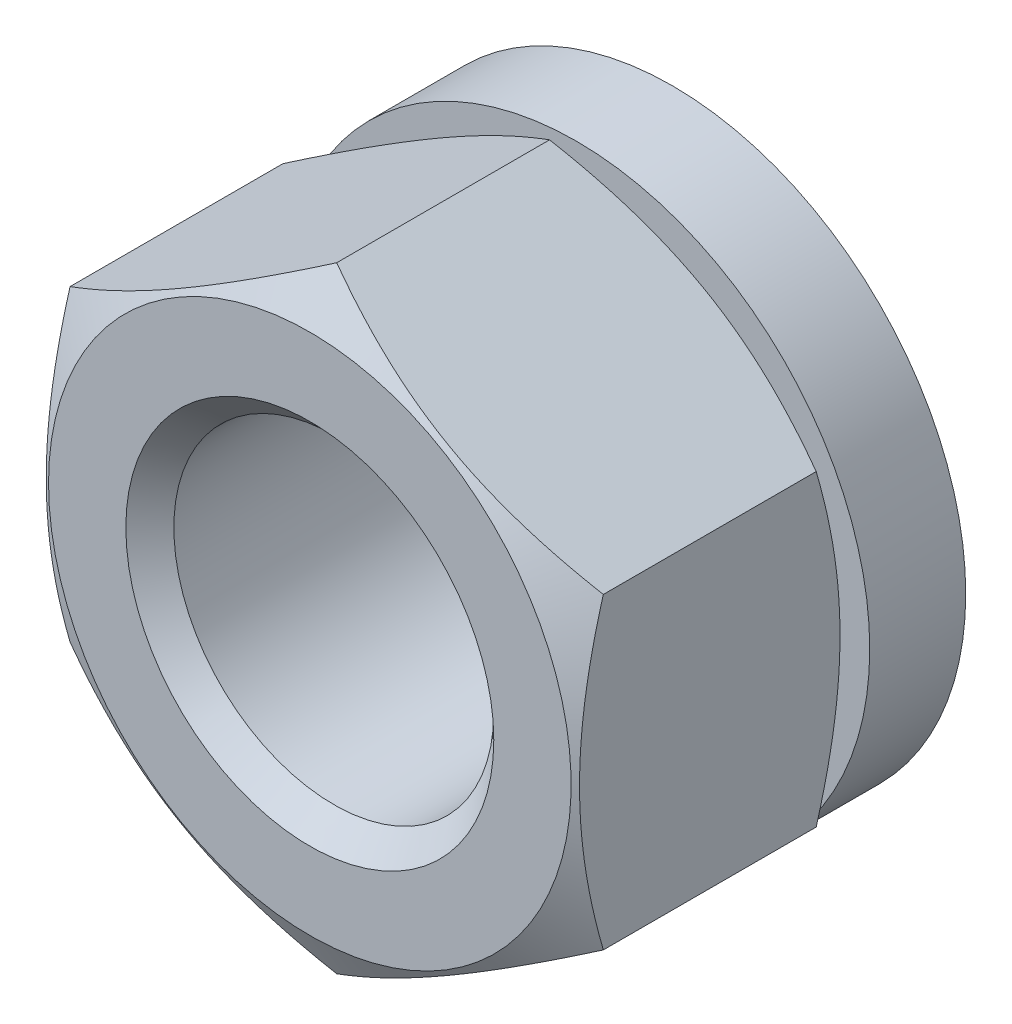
ISO-10303-21;
HEADER;
FILE_DESCRIPTION(('STEP AP214'),'2;1');
FILE_NAME('part.step','',(''),(''),'','','');
FILE_SCHEMA(('AUTOMOTIVE_DESIGN { 1 0 10303 214 1 1 1 1 }'));
ENDSEC;
DATA;
#1=APPLICATION_CONTEXT('core data for automotive mechanical design processes');
#2=APPLICATION_PROTOCOL_DEFINITION('international standard','automotive_design',2000,#1);
#3=PRODUCT_CONTEXT('',#1,'mechanical');
#4=PRODUCT('Part','Part','',(#3));
#5=PRODUCT_RELATED_PRODUCT_CATEGORY('part','',(#4));
#6=PRODUCT_DEFINITION_FORMATION('','',#4);
#7=PRODUCT_DEFINITION_CONTEXT('part definition',#1,'design');
#8=PRODUCT_DEFINITION('design','',#6,#7);
#9=PRODUCT_DEFINITION_SHAPE('','',#8);
#10=(LENGTH_UNIT() NAMED_UNIT(*) SI_UNIT(.MILLI.,.METRE.));
#11=(NAMED_UNIT(*) PLANE_ANGLE_UNIT() SI_UNIT($,.RADIAN.));
#12=(NAMED_UNIT(*) SI_UNIT($,.STERADIAN.) SOLID_ANGLE_UNIT());
#13=UNCERTAINTY_MEASURE_WITH_UNIT(LENGTH_MEASURE(1.E-05),#10,'distance_accuracy_value','');
#14=(GEOMETRIC_REPRESENTATION_CONTEXT(3) GLOBAL_UNCERTAINTY_ASSIGNED_CONTEXT((#13)) GLOBAL_UNIT_ASSIGNED_CONTEXT((#10,
#11,#12)) REPRESENTATION_CONTEXT('',''));
#15=CARTESIAN_POINT('',(0.,0.,0.));
#16=DIRECTION('',(0.,0.,1.));
#17=DIRECTION('',(1.,0.,0.));
#18=AXIS2_PLACEMENT_3D('',#15,#16,#17);
#19=CARTESIAN_POINT('',(0.,0.,1.8));
#20=DIRECTION('',(0.,0.,1.));
#21=DIRECTION('',(1.,0.,0.));
#22=AXIS2_PLACEMENT_3D('',#19,#20,#21);
#23=PLANE('',#22);
#24=CARTESIAN_POINT('',(0.,0.,1.8));
#25=DIRECTION('',(0.,0.,1.));
#26=DIRECTION('',(1.,0.,0.));
#27=AXIS2_PLACEMENT_3D('',#24,#25,#26);
#28=CIRCLE('',#27,5.5);
#29=CARTESIAN_POINT('',(5.5,0.,1.8));
#30=VERTEX_POINT('',#29);
#31=EDGE_CURVE('E117',#30,#30,#28,.T.);
#32=ORIENTED_EDGE('',*,*,#31,.T.);
#33=EDGE_LOOP('',(#32));
#34=FACE_BOUND('',#33,.T.);
#35=CARTESIAN_POINT('',(0.,0.,1.8));
#36=DIRECTION('',(0.,0.,-1.));
#37=DIRECTION('',(-1.,0.,0.));
#38=AXIS2_PLACEMENT_3D('',#35,#36,#37);
#39=CIRCLE('',#38,4.9);
#40=CARTESIAN_POINT('',(-4.9,0.,1.8));
#41=VERTEX_POINT('',#40);
#42=EDGE_CURVE('E209',#41,#41,#39,.T.);
#43=ORIENTED_EDGE('',*,*,#42,.T.);
#44=EDGE_LOOP('',(#43));
#45=FACE_BOUND('',#44,.T.);
#46=ADVANCED_FACE('F14',(#34,#45),#23,.T.);
#47=CARTESIAN_POINT('',(0.,0.,0.));
#48=DIRECTION('',(0.,0.,1.));
#49=DIRECTION('',(1.,0.,0.));
#50=AXIS2_PLACEMENT_3D('',#47,#48,#49);
#51=PLANE('',#50);
#52=CARTESIAN_POINT('',(0.,0.,0.));
#53=DIRECTION('',(0.,0.,1.));
#54=DIRECTION('',(1.,0.,0.));
#55=AXIS2_PLACEMENT_3D('',#52,#53,#54);
#56=CIRCLE('',#55,5.5);
#57=CARTESIAN_POINT('',(5.5,0.,0.));
#58=VERTEX_POINT('',#57);
#59=EDGE_CURVE('E114',#58,#58,#56,.T.);
#60=ORIENTED_EDGE('',*,*,#59,.F.);
#61=EDGE_LOOP('',(#60));
#62=FACE_BOUND('',#61,.T.);
#63=CARTESIAN_POINT('',(0.,0.,0.));
#64=DIRECTION('',(0.,0.,1.));
#65=DIRECTION('',(1.,0.,0.));
#66=AXIS2_PLACEMENT_3D('',#63,#64,#65);
#67=CIRCLE('',#66,3.);
#68=CARTESIAN_POINT('',(3.,0.,0.));
#69=VERTEX_POINT('',#68);
#70=EDGE_CURVE('E111',#69,#69,#67,.T.);
#71=ORIENTED_EDGE('',*,*,#70,.T.);
#72=EDGE_LOOP('',(#71));
#73=FACE_BOUND('',#72,.T.);
#74=ADVANCED_FACE('F233',(#62,#73),#51,.F.);
#75=CARTESIAN_POINT('',(0.,0.,1.8));
#76=DIRECTION('',(0.,0.,-1.));
#77=DIRECTION('',(-1.,0.,0.));
#78=AXIS2_PLACEMENT_3D('',#75,#76,#77);
#79=CYLINDRICAL_SURFACE('',#78,5.5);
#80=ORIENTED_EDGE('',*,*,#31,.F.);
#81=EDGE_LOOP('',(#80));
#82=FACE_BOUND('',#81,.T.);
#83=ORIENTED_EDGE('',*,*,#59,.T.);
#84=EDGE_LOOP('',(#83));
#85=FACE_BOUND('',#84,.T.);
#86=ADVANCED_FACE('F231',(#82,#85),#79,.T.);
#87=CARTESIAN_POINT('',(0.,0.,1.8));
#88=DIRECTION('',(0.,0.,-1.));
#89=DIRECTION('',(-1.,0.,0.));
#90=AXIS2_PLACEMENT_3D('',#87,#88,#89);
#91=CYLINDRICAL_SURFACE('',#90,3.);
#92=CARTESIAN_POINT('',(0.,0.,6.35));
#93=DIRECTION('',(0.,0.,1.));
#94=DIRECTION('',(1.,0.,0.));
#95=AXIS2_PLACEMENT_3D('',#92,#93,#94);
#96=CIRCLE('',#95,3.);
#97=CARTESIAN_POINT('',(3.,0.,6.35));
#98=VERTEX_POINT('',#97);
#99=EDGE_CURVE('E120',#98,#98,#96,.T.);
#100=ORIENTED_EDGE('',*,*,#99,.T.);
#101=EDGE_LOOP('',(#100));
#102=FACE_BOUND('',#101,.T.);
#103=ORIENTED_EDGE('',*,*,#70,.F.);
#104=EDGE_LOOP('',(#103));
#105=FACE_BOUND('',#104,.T.);
#106=ADVANCED_FACE('F227',(#102,#105),#91,.F.);
#107=CARTESIAN_POINT('',(-9.99999533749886,0.,6.8));
#108=DIRECTION('',(0.,0.,1.));
#109=DIRECTION('',(1.,0.,0.));
#110=AXIS2_PLACEMENT_3D('',#107,#108,#109);
#111=PLANE('',#110);
#112=CARTESIAN_POINT('',(0.,0.,6.8));
#113=DIRECTION('',(0.,0.,-1.));
#114=DIRECTION('',(-1.,0.,0.));
#115=AXIS2_PLACEMENT_3D('',#112,#113,#114);
#116=CIRCLE('',#115,4.9);
#117=CARTESIAN_POINT('',(-4.9,0.,6.8));
#118=VERTEX_POINT('',#117);
#119=EDGE_CURVE('E84',#118,#118,#116,.T.);
#120=ORIENTED_EDGE('',*,*,#119,.F.);
#121=EDGE_LOOP('',(#120));
#122=FACE_BOUND('',#121,.T.);
#123=CARTESIAN_POINT('',(0.,0.,6.8));
#124=DIRECTION('',(0.,0.,1.));
#125=DIRECTION('',(1.,0.,0.));
#126=AXIS2_PLACEMENT_3D('',#123,#124,#125);
#127=CIRCLE('',#126,3.45);
#128=CARTESIAN_POINT('',(3.45,0.,6.8));
#129=VERTEX_POINT('',#128);
#130=EDGE_CURVE('E123',#129,#129,#127,.F.);
#131=ORIENTED_EDGE('',*,*,#130,.T.);
#132=EDGE_LOOP('',(#131));
#133=FACE_BOUND('',#132,.T.);
#134=ADVANCED_FACE('F136',(#122,#133),#111,.T.);
#135=CARTESIAN_POINT('',(4.99999766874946,2.88675,6.8));
#136=DIRECTION('',(-0.5,-0.866025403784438,0.));
#137=DIRECTION('',(0.866025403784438,-0.5,0.));
#138=AXIS2_PLACEMENT_3D('',#135,#136,#137);
#139=PLANE('',#138);
#140=DIRECTION('',(0.,0.,-1.));
#141=VECTOR('',#140,1.);
#142=CARTESIAN_POINT('',(4.99999766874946,2.88675,6.8));
#143=LINE('',#142,#141);
#144=CARTESIAN_POINT('',(4.99999766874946,2.88675,6.29568453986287));
#145=VERTEX_POINT('',#144);
#146=CARTESIAN_POINT('',(4.99999766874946,2.88675,2.30431546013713));
#147=VERTEX_POINT('',#146);
#148=EDGE_CURVE('E83',#145,#147,#143,.T.);
#149=ORIENTED_EDGE('',*,*,#148,.T.);
#150=CARTESIAN_POINT('',(5.00019766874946,2.88663452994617,2.30438212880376));
#151=CARTESIAN_POINT('',(4.78046317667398,3.01349829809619,2.23112007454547));
#152=CARTESIAN_POINT('',(4.55884929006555,3.14144713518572,2.1644848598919));
#153=CARTESIAN_POINT('',(4.11178408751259,3.39956035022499,2.04817258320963));
#154=CARTESIAN_POINT('',(3.88632482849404,3.52972931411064,1.99853666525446));
#155=CARTESIAN_POINT('',(3.43816609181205,3.78847388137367,1.92128467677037));
#156=CARTESIAN_POINT('',(3.21553640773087,3.91700918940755,1.89315404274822));
#157=CARTESIAN_POINT('',(2.88080875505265,4.11026428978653,1.86792859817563));
#158=CARTESIAN_POINT('',(2.76915651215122,4.17472674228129,1.86234713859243));
#159=CARTESIAN_POINT('',(2.54574884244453,4.30371122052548,1.85693589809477));
#160=CARTESIAN_POINT('',(2.43399341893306,4.36823324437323,1.85710593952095));
#161=CARTESIAN_POINT('',(2.12781477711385,4.54500556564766,1.86548730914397));
#162=CARTESIAN_POINT('',(1.933493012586,4.65719728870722,1.87956344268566));
#163=CARTESIAN_POINT('',(1.54613917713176,4.88083612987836,1.92419890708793));
#164=CARTESIAN_POINT('',(1.35310846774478,4.99228246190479,1.95477349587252));
#165=CARTESIAN_POINT('',(0.964974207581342,5.21637188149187,2.03120209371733));
#166=CARTESIAN_POINT('',(0.769919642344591,5.32898668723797,2.07737995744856));
#167=CARTESIAN_POINT('',(0.382719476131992,5.55253680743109,2.18218532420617));
#168=CARTESIAN_POINT('',(0.190568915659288,5.66347498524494,2.24078820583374));
#169=CARTESIAN_POINT('',(-0.000199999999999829,5.77361547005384,2.30438212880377));
#170=B_SPLINE_CURVE_WITH_KNOTS('',3,(#150,#151,#152,#153,#154,#155,#156,#157,#158,#159,#160,
#161,#162,#163,#164,#165,#166,#167,#168,#169),.UNSPECIFIED.,.F.,.F.,(4,2,2,2,2,2,2,2,2,4),(0.,
0.792555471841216,1.58701586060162,2.36181427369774,2.74883947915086,3.1358527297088,
3.80962184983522,4.48401514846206,5.17336641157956,5.86136421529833),.UNSPECIFIED.);
#171=CARTESIAN_POINT('',(0.,5.7735,2.30431546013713));
#172=VERTEX_POINT('',#171);
#173=EDGE_CURVE('E71',#147,#172,#170,.T.);
#174=ORIENTED_EDGE('',*,*,#173,.T.);
#175=DIRECTION('',(0.,0.,-1.));
#176=VECTOR('',#175,1.);
#177=CARTESIAN_POINT('',(0.,5.7735,6.8));
#178=LINE('',#177,#176);
#179=CARTESIAN_POINT('',(0.,5.7735,6.29568453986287));
#180=VERTEX_POINT('',#179);
#181=EDGE_CURVE('E81',#180,#172,#178,.T.);
#182=ORIENTED_EDGE('',*,*,#181,.F.);
#183=CARTESIAN_POINT('',(-0.0002,5.77361547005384,6.29561787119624));
#184=CARTESIAN_POINT('',(0.219534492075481,5.64675170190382,6.36887992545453));
#185=CARTESIAN_POINT('',(0.441148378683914,5.51880286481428,6.43551514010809));
#186=CARTESIAN_POINT('',(0.888213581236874,5.26068964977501,6.55182741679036));
#187=CARTESIAN_POINT('',(1.11367284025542,5.13052068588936,6.60146333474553));
#188=CARTESIAN_POINT('',(1.56183157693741,4.87177611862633,6.67871532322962));
#189=CARTESIAN_POINT('',(1.7844612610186,4.74324081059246,6.70684595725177));
#190=CARTESIAN_POINT('',(2.11918891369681,4.54998571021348,6.73207140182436));
#191=CARTESIAN_POINT('',(2.23084115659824,4.48552325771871,6.73765286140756));
#192=CARTESIAN_POINT('',(2.45424882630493,4.35653877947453,6.74306410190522));
#193=CARTESIAN_POINT('',(2.5660042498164,4.29201675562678,6.74289406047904));
#194=CARTESIAN_POINT('',(2.87218289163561,4.11524443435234,6.73451269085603));
#195=CARTESIAN_POINT('',(3.06650465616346,4.00305271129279,6.72043655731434));
#196=CARTESIAN_POINT('',(3.4538584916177,3.77941387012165,6.67580109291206));
#197=CARTESIAN_POINT('',(3.64688920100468,3.66796753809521,6.64522650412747));
#198=CARTESIAN_POINT('',(4.03502346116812,3.44387811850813,6.56879790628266));
#199=CARTESIAN_POINT('',(4.23007802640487,3.33126331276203,6.52262004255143));
#200=CARTESIAN_POINT('',(4.61727819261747,3.10771319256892,6.41781467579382));
#201=CARTESIAN_POINT('',(4.80942875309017,2.99677501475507,6.35921179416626));
#202=CARTESIAN_POINT('',(5.00019766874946,2.88663452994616,6.29561787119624));
#203=B_SPLINE_CURVE_WITH_KNOTS('',3,(#183,#184,#185,#186,#187,#188,#189,#190,#191,#192,#193,
#194,#195,#196,#197,#198,#199,#200,#201,#202),.UNSPECIFIED.,.F.,.F.,(4,2,2,2,2,2,2,2,2,4),(0.,
0.792555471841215,1.58701586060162,2.36181427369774,2.74883947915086,3.1358527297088,
3.80962184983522,4.48401514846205,5.17336641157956,5.86136421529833),.UNSPECIFIED.);
#204=EDGE_CURVE('E42',#180,#145,#203,.T.);
#205=ORIENTED_EDGE('',*,*,#204,.T.);
#206=EDGE_LOOP('',(#149,#174,#182,#205));
#207=FACE_BOUND('',#206,.T.);
#208=ADVANCED_FACE('F80',(#207),#139,.F.);
#209=CARTESIAN_POINT('',(4.99999766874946,-2.88675,6.8));
#210=DIRECTION('',(-1.,0.,0.));
#211=DIRECTION('',(0.,0.,1.));
#212=AXIS2_PLACEMENT_3D('',#209,#210,#211);
#213=PLANE('',#212);
#214=DIRECTION('',(0.,0.,-1.));
#215=VECTOR('',#214,1.);
#216=CARTESIAN_POINT('',(4.99999766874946,-2.88675,6.8));
#217=LINE('',#216,#215);
#218=CARTESIAN_POINT('',(4.99999766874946,-2.88675,6.29568453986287));
#219=VERTEX_POINT('',#218);
#220=CARTESIAN_POINT('',(4.99999766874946,-2.88675,2.30431546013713));
#221=VERTEX_POINT('',#220);
#222=EDGE_CURVE('E89',#219,#221,#217,.T.);
#223=ORIENTED_EDGE('',*,*,#222,.T.);
#224=CARTESIAN_POINT('',(4.99999766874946,-7.73083898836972,4.28655352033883));
#225=CARTESIAN_POINT('',(4.99999766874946,-7.51265206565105,4.18080730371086));
#226=CARTESIAN_POINT('',(4.99999766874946,-7.2939617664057,4.07608179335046));
#227=CARTESIAN_POINT('',(4.99999766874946,-6.85530663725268,3.86924672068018));
#228=CARTESIAN_POINT('',(4.99999766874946,-6.63534161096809,3.76713757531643));
#229=CARTESIAN_POINT('',(4.99999766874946,-6.19272468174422,3.56559105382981));
#230=CARTESIAN_POINT('',(4.99999766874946,-5.97006465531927,3.46617145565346));
#231=CARTESIAN_POINT('',(4.99999766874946,-5.52296546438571,3.27143209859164));
#232=CARTESIAN_POINT('',(4.99999766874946,-5.29852638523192,3.17611214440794));
#233=CARTESIAN_POINT('',(4.99999766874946,-4.84035541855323,2.9877123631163));
#234=CARTESIAN_POINT('',(4.99999766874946,-4.60655453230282,2.89479941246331));
#235=CARTESIAN_POINT('',(4.99999766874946,-4.13620877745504,2.71606219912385));
#236=CARTESIAN_POINT('',(4.99999766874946,-3.89966360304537,2.63023873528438));
#237=CARTESIAN_POINT('',(4.99999766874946,-3.4239033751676,2.46795062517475));
#238=CARTESIAN_POINT('',(4.99999766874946,-3.18469492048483,2.39146682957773));
#239=CARTESIAN_POINT('',(4.99999766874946,-2.70284683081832,2.25032775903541));
#240=CARTESIAN_POINT('',(4.99999766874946,-2.46020831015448,2.18566873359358));
#241=CARTESIAN_POINT('',(4.99999766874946,-1.97270641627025,2.07164072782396));
#242=CARTESIAN_POINT('',(4.99999766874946,-1.72786261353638,2.02218962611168));
#243=CARTESIAN_POINT('',(4.99999766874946,-1.23515464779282,1.94138820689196));
#244=CARTESIAN_POINT('',(4.99999766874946,-0.987290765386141,1.91003622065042));
#245=CARTESIAN_POINT('',(4.99999766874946,-0.493008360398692,1.86834499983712));
#246=CARTESIAN_POINT('',(4.99999766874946,-0.246613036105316,1.85773749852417));
#247=CARTESIAN_POINT('',(4.99999766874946,0.246197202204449,1.85772986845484));
#248=CARTESIAN_POINT('',(4.99999766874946,0.492612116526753,1.86833019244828));
#249=CARTESIAN_POINT('',(4.99999766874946,0.911647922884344,1.90364282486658));
#250=CARTESIAN_POINT('',(4.99999766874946,1.08471961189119,1.92330558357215));
#251=CARTESIAN_POINT('',(4.99999766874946,1.42957310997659,1.9718562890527));
#252=CARTESIAN_POINT('',(4.99999766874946,1.60135473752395,2.00074551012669));
#253=CARTESIAN_POINT('',(4.99999766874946,2.1145489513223,2.09973202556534));
#254=CARTESIAN_POINT('',(4.99999766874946,2.45361425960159,2.18212942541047));
#255=CARTESIAN_POINT('',(4.99999766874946,2.96057356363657,2.3247149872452));
#256=CARTESIAN_POINT('',(4.99999766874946,3.13110294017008,2.37606424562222));
#257=CARTESIAN_POINT('',(4.99999766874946,3.47050458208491,2.48402252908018));
#258=CARTESIAN_POINT('',(4.99999766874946,3.63937683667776,2.54063158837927));
#259=CARTESIAN_POINT('',(4.99999766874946,3.97551914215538,2.65820717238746));
#260=CARTESIAN_POINT('',(4.99999766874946,4.14278971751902,2.71917221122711));
#261=CARTESIAN_POINT('',(4.99999766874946,4.47595000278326,2.84474986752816));
#262=CARTESIAN_POINT('',(4.99999766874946,4.64183972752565,2.90936244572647));
#263=CARTESIAN_POINT('',(4.99999766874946,5.02780288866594,3.06379998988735));
#264=CARTESIAN_POINT('',(4.99999766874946,5.24739876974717,3.15481611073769));
#265=CARTESIAN_POINT('',(4.99999766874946,5.68476734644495,3.34113984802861));
#266=CARTESIAN_POINT('',(4.99999766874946,5.90253993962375,3.43644770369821));
#267=CARTESIAN_POINT('',(4.99999766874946,6.3365907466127,3.63050781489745));
#268=CARTESIAN_POINT('',(4.99999766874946,6.55286866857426,3.72926072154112));
#269=CARTESIAN_POINT('',(4.99999766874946,6.98413899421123,3.92953882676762));
#270=CARTESIAN_POINT('',(4.99999766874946,7.1991313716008,4.0310640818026));
#271=CARTESIAN_POINT('',(4.99999766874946,7.84290151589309,4.33919676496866));
#272=CARTESIAN_POINT('',(4.99999766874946,8.27006431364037,4.54917622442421));
#273=CARTESIAN_POINT('',(4.99999766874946,9.12132648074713,4.9752546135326));
#274=CARTESIAN_POINT('',(4.99999766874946,9.54542574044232,5.19135376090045));
#275=CARTESIAN_POINT('',(4.99999766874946,10.1625797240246,5.50985459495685));
#276=CARTESIAN_POINT('',(4.99999766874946,10.356527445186,5.61053098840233));
#277=CARTESIAN_POINT('',(4.99999766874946,10.7440005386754,5.81268493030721));
#278=CARTESIAN_POINT('',(4.99999766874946,10.9375259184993,5.91416246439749));
#279=CARTESIAN_POINT('',(4.99999766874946,11.5175694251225,6.21964401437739));
#280=CARTESIAN_POINT('',(4.99999766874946,11.903539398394,6.42468894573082));
#281=CARTESIAN_POINT('',(4.99999766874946,12.6734229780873,6.83640574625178));
#282=CARTESIAN_POINT('',(4.99999766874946,13.0573392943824,7.04307255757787));
#283=CARTESIAN_POINT('',(4.99999766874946,13.8242428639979,7.45807519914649));
#284=CARTESIAN_POINT('',(4.99999766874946,14.207230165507,7.66641094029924));
#285=CARTESIAN_POINT('',(4.99999766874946,14.5898738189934,7.87537201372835));
#286=B_SPLINE_CURVE_WITH_KNOTS('',3,(#224,#225,#226,#227,#228,#229,#230,#231,#232,#233,#234,
#235,#236,#237,#238,#239,#240,#241,#242,#243,#244,#245,#246,#247,#248,#249,#250,#251,#252,#253,
#254,#255,#256,#257,#258,#259,#260,#261,#262,#263,#264,#265,#266,#267,#268,#269,#270,#271,#272,
#273,#274,#275,#276,#277,#278,#279,#280,#281,#282,#283,#284,#285),.UNSPECIFIED.,.F.,.F.,(4,2,2,
2,2,2,2,2,2,2,2,2,2,2,2,2,2,2,2,2,2,2,2,2,2,2,2,2,2,2,4),(0.,0.727394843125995,1.45490489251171,
2.1864151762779,2.91789057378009,3.67256066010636,4.4273156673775,5.18049623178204,
5.93343749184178,6.68223850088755,7.43097045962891,8.16995409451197,8.90895350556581,
9.43125480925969,9.95362828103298,10.9989650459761,11.5331988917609,12.0674362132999,
12.6014921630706,13.1355423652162,13.8486129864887,14.561723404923,15.2749693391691,
15.9882298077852,17.4160941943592,18.8440094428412,19.4995711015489,20.1551210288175,
21.4662733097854,22.7742928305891,24.0822429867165),.UNSPECIFIED.);
#287=EDGE_CURVE('E85',#221,#147,#286,.T.);
#288=ORIENTED_EDGE('',*,*,#287,.T.);
#289=ORIENTED_EDGE('',*,*,#148,.F.);
#290=CARTESIAN_POINT('',(4.99999766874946,-7.73083898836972,4.31344647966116));
#291=CARTESIAN_POINT('',(4.99999766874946,-7.51265206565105,4.41919269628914));
#292=CARTESIAN_POINT('',(4.99999766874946,-7.2939617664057,4.52391820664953));
#293=CARTESIAN_POINT('',(4.99999766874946,-6.85530663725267,4.73075327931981));
#294=CARTESIAN_POINT('',(4.99999766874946,-6.63534161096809,4.83286242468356));
#295=CARTESIAN_POINT('',(4.99999766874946,-6.19272468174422,5.03440894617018));
#296=CARTESIAN_POINT('',(4.99999766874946,-5.97006465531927,5.13382854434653));
#297=CARTESIAN_POINT('',(4.99999766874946,-5.52296546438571,5.32856790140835));
#298=CARTESIAN_POINT('',(4.99999766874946,-5.29852638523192,5.42388785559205));
#299=CARTESIAN_POINT('',(4.99999766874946,-4.84035541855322,5.61228763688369));
#300=CARTESIAN_POINT('',(4.99999766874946,-4.60655453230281,5.70520058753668));
#301=CARTESIAN_POINT('',(4.99999766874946,-4.13620877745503,5.88393780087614));
#302=CARTESIAN_POINT('',(4.99999766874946,-3.89966360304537,5.96976126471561));
#303=CARTESIAN_POINT('',(4.99999766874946,-3.4239033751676,6.13204937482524));
#304=CARTESIAN_POINT('',(4.99999766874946,-3.18469492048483,6.20853317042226));
#305=CARTESIAN_POINT('',(4.99999766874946,-2.70284683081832,6.34967224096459));
#306=CARTESIAN_POINT('',(4.99999766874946,-2.46020831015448,6.41433126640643));
#307=CARTESIAN_POINT('',(4.99999766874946,-1.97270641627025,6.52835927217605));
#308=CARTESIAN_POINT('',(4.99999766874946,-1.72786261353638,6.57781037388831));
#309=CARTESIAN_POINT('',(4.99999766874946,-1.23515464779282,6.65861179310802));
#310=CARTESIAN_POINT('',(4.99999766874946,-0.987290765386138,6.68996377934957));
#311=CARTESIAN_POINT('',(4.99999766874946,-0.493008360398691,6.73165500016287));
#312=CARTESIAN_POINT('',(4.99999766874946,-0.246613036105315,6.74226250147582));
#313=CARTESIAN_POINT('',(4.99999766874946,0.24619720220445,6.74227013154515));
#314=CARTESIAN_POINT('',(4.99999766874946,0.492612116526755,6.73166980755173));
#315=CARTESIAN_POINT('',(4.99999766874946,0.911647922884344,6.69635717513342));
#316=CARTESIAN_POINT('',(4.99999766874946,1.08471961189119,6.67669441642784));
#317=CARTESIAN_POINT('',(4.99999766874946,1.42957310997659,6.62814371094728));
#318=CARTESIAN_POINT('',(4.99999766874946,1.60135473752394,6.5992544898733));
#319=CARTESIAN_POINT('',(4.99999766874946,2.1145489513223,6.50026797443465));
#320=CARTESIAN_POINT('',(4.99999766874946,2.45361425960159,6.41787057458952));
#321=CARTESIAN_POINT('',(4.99999766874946,2.96057356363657,6.27528501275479));
#322=CARTESIAN_POINT('',(4.99999766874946,3.13110294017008,6.22393575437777));
#323=CARTESIAN_POINT('',(4.99999766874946,3.47050458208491,6.11597747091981));
#324=CARTESIAN_POINT('',(4.99999766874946,3.63937683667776,6.05936841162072));
#325=CARTESIAN_POINT('',(4.99999766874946,3.97551914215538,5.94179282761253));
#326=CARTESIAN_POINT('',(4.99999766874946,4.14278971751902,5.88082778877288));
#327=CARTESIAN_POINT('',(4.99999766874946,4.47595000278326,5.75525013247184));
#328=CARTESIAN_POINT('',(4.99999766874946,4.64183972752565,5.69063755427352));
#329=CARTESIAN_POINT('',(4.99999766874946,5.02780288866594,5.53620001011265));
#330=CARTESIAN_POINT('',(4.99999766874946,5.24739876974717,5.4451838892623));
#331=CARTESIAN_POINT('',(4.99999766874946,5.68476734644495,5.25886015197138));
#332=CARTESIAN_POINT('',(4.99999766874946,5.90253993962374,5.16355229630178));
#333=CARTESIAN_POINT('',(4.99999766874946,6.3365907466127,4.96949218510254));
#334=CARTESIAN_POINT('',(4.99999766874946,6.55286866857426,4.87073927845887));
#335=CARTESIAN_POINT('',(4.99999766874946,6.98413899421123,4.67046117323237));
#336=CARTESIAN_POINT('',(4.99999766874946,7.1991313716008,4.56893591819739));
#337=CARTESIAN_POINT('',(4.99999766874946,7.84290151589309,4.26080323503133));
#338=CARTESIAN_POINT('',(4.99999766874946,8.27006431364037,4.05082377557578));
#339=CARTESIAN_POINT('',(4.99999766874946,9.12132648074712,3.62474538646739));
#340=CARTESIAN_POINT('',(4.99999766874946,9.54542574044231,3.40864623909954));
#341=CARTESIAN_POINT('',(4.99999766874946,10.1625797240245,3.09014540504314));
#342=CARTESIAN_POINT('',(4.99999766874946,10.356527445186,2.98946901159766));
#343=CARTESIAN_POINT('',(4.99999766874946,10.7440005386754,2.78731506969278));
#344=CARTESIAN_POINT('',(4.99999766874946,10.9375259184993,2.6858375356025));
#345=CARTESIAN_POINT('',(4.99999766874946,11.5175694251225,2.3803559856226));
#346=CARTESIAN_POINT('',(4.99999766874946,11.903539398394,2.17531105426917));
#347=CARTESIAN_POINT('',(4.99999766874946,12.6734229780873,1.76359425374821));
#348=CARTESIAN_POINT('',(4.99999766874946,13.0573392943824,1.55692744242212));
#349=CARTESIAN_POINT('',(4.99999766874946,13.8242428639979,1.14192480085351));
#350=CARTESIAN_POINT('',(4.99999766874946,14.207230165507,0.933589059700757));
#351=CARTESIAN_POINT('',(4.99999766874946,14.5898738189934,0.724627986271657));
#352=B_SPLINE_CURVE_WITH_KNOTS('',3,(#290,#291,#292,#293,#294,#295,#296,#297,#298,#299,#300,
#301,#302,#303,#304,#305,#306,#307,#308,#309,#310,#311,#312,#313,#314,#315,#316,#317,#318,#319,
#320,#321,#322,#323,#324,#325,#326,#327,#328,#329,#330,#331,#332,#333,#334,#335,#336,#337,#338,
#339,#340,#341,#342,#343,#344,#345,#346,#347,#348,#349,#350,#351),.UNSPECIFIED.,.F.,.F.,(4,2,2,
2,2,2,2,2,2,2,2,2,2,2,2,2,2,2,2,2,2,2,2,2,2,2,2,2,2,2,4),(0.,0.727394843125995,1.45490489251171,
2.1864151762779,2.91789057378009,3.67256066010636,4.42731566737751,5.18049623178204,
5.93343749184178,6.68223850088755,7.43097045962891,8.16995409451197,8.90895350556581,
9.43125480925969,9.95362828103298,10.9989650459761,11.5331988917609,12.0674362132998,
12.6014921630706,13.1355423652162,13.8486129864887,14.561723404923,15.2749693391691,
15.9882298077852,17.4160941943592,18.8440094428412,19.4995711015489,20.1551210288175,
21.4662733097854,22.7742928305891,24.0822429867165),.UNSPECIFIED.);
#353=EDGE_CURVE('E91',#145,#219,#352,.F.);
#354=ORIENTED_EDGE('',*,*,#353,.T.);
#355=EDGE_LOOP('',(#223,#288,#289,#354));
#356=FACE_BOUND('',#355,.T.);
#357=ADVANCED_FACE('F170',(#356),#213,.F.);
#358=CARTESIAN_POINT('',(0.,-5.7735,6.8));
#359=DIRECTION('',(-0.5,0.866025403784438,0.));
#360=DIRECTION('',(-0.866025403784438,-0.5,0.));
#361=AXIS2_PLACEMENT_3D('',#358,#359,#360);
#362=PLANE('',#361);
#363=DIRECTION('',(0.,0.,-1.));
#364=VECTOR('',#363,1.);
#365=CARTESIAN_POINT('',(0.,-5.7735,6.8));
#366=LINE('',#365,#364);
#367=CARTESIAN_POINT('',(0.,-5.7735,6.29568453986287));
#368=VERTEX_POINT('',#367);
#369=CARTESIAN_POINT('',(0.,-5.7735,2.30431546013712));
#370=VERTEX_POINT('',#369);
#371=EDGE_CURVE('E103',#368,#370,#366,.T.);
#372=ORIENTED_EDGE('',*,*,#371,.T.);
#373=CARTESIAN_POINT('',(-0.000200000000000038,-5.77361547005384,2.30438212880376));
#374=CARTESIAN_POINT('',(0.219534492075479,-5.64675170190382,2.23112007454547));
#375=CARTESIAN_POINT('',(0.441148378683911,-5.51880286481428,2.1644848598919));
#376=CARTESIAN_POINT('',(0.88821358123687,-5.26068964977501,2.04817258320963));
#377=CARTESIAN_POINT('',(1.11367284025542,-5.13052068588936,1.99853666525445));
#378=CARTESIAN_POINT('',(1.56183157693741,-4.87177611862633,1.92128467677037));
#379=CARTESIAN_POINT('',(1.78446126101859,-4.74324081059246,1.89315404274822));
#380=CARTESIAN_POINT('',(2.11918891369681,-4.54998571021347,1.86792859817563));
#381=CARTESIAN_POINT('',(2.23084115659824,-4.48552325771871,1.86234713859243));
#382=CARTESIAN_POINT('',(2.45424882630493,-4.35653877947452,1.85693589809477));
#383=CARTESIAN_POINT('',(2.5660042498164,-4.29201675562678,1.85710593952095));
#384=CARTESIAN_POINT('',(2.87218289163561,-4.11524443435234,1.86548730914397));
#385=CARTESIAN_POINT('',(3.06650465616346,-4.00305271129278,1.87956344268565));
#386=CARTESIAN_POINT('',(3.4538584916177,-3.77941387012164,1.92419890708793));
#387=CARTESIAN_POINT('',(3.64688920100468,-3.66796753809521,1.95477349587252));
#388=CARTESIAN_POINT('',(4.03502346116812,-3.44387811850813,2.03120209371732));
#389=CARTESIAN_POINT('',(4.23007802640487,-3.33126331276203,2.07737995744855));
#390=CARTESIAN_POINT('',(4.61727819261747,-3.10771319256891,2.18218532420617));
#391=CARTESIAN_POINT('',(4.80942875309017,-2.99677501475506,2.24078820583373));
#392=CARTESIAN_POINT('',(5.00019766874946,-2.88663452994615,2.30438212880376));
#393=B_SPLINE_CURVE_WITH_KNOTS('',3,(#373,#374,#375,#376,#377,#378,#379,#380,#381,#382,#383,
#384,#385,#386,#387,#388,#389,#390,#391,#392),.UNSPECIFIED.,.F.,.F.,(4,2,2,2,2,2,2,2,2,4),(0.,
0.792555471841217,1.58701586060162,2.36181427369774,2.74883947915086,3.1358527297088,
3.80962184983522,4.48401514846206,5.17336641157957,5.86136421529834),.UNSPECIFIED.);
#394=EDGE_CURVE('E184',#370,#221,#393,.T.);
#395=ORIENTED_EDGE('',*,*,#394,.T.);
#396=ORIENTED_EDGE('',*,*,#222,.F.);
#397=CARTESIAN_POINT('',(5.00019766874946,-2.88663452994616,6.29561787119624));
#398=CARTESIAN_POINT('',(4.78046317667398,-3.01349829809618,6.36887992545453));
#399=CARTESIAN_POINT('',(4.55884929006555,-3.14144713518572,6.43551514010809));
#400=CARTESIAN_POINT('',(4.11178408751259,-3.39956035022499,6.55182741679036));
#401=CARTESIAN_POINT('',(3.88632482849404,-3.52972931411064,6.60146333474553));
#402=CARTESIAN_POINT('',(3.43816609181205,-3.78847388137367,6.67871532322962));
#403=CARTESIAN_POINT('',(3.21553640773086,-3.91700918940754,6.70684595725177));
#404=CARTESIAN_POINT('',(2.88080875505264,-4.11026428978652,6.73207140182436));
#405=CARTESIAN_POINT('',(2.76915651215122,-4.17472674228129,6.73765286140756));
#406=CARTESIAN_POINT('',(2.54574884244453,-4.30371122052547,6.74306410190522));
#407=CARTESIAN_POINT('',(2.43399341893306,-4.36823324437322,6.74289406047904));
#408=CARTESIAN_POINT('',(2.12781477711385,-4.54500556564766,6.73451269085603));
#409=CARTESIAN_POINT('',(1.933493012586,-4.65719728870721,6.72043655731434));
#410=CARTESIAN_POINT('',(1.54613917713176,-4.88083612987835,6.67580109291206));
#411=CARTESIAN_POINT('',(1.35310846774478,-4.99228246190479,6.64522650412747));
#412=CARTESIAN_POINT('',(0.964974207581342,-5.21637188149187,6.56879790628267));
#413=CARTESIAN_POINT('',(0.769919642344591,-5.32898668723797,6.52262004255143));
#414=CARTESIAN_POINT('',(0.382719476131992,-5.55253680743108,6.41781467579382));
#415=CARTESIAN_POINT('',(0.190568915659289,-5.66347498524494,6.35921179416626));
#416=CARTESIAN_POINT('',(-0.000200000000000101,-5.77361547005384,6.29561787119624));
#417=B_SPLINE_CURVE_WITH_KNOTS('',3,(#397,#398,#399,#400,#401,#402,#403,#404,#405,#406,#407,
#408,#409,#410,#411,#412,#413,#414,#415,#416),.UNSPECIFIED.,.F.,.F.,(4,2,2,2,2,2,2,2,2,4),(0.,
0.792555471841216,1.58701586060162,2.36181427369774,2.74883947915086,3.1358527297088,
3.80962184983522,4.48401514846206,5.17336641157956,5.86136421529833),.UNSPECIFIED.);
#418=EDGE_CURVE('E158',#219,#368,#417,.T.);
#419=ORIENTED_EDGE('',*,*,#418,.T.);
#420=EDGE_LOOP('',(#372,#395,#396,#419));
#421=FACE_BOUND('',#420,.T.);
#422=ADVANCED_FACE('F173',(#421),#362,.F.);
#423=CARTESIAN_POINT('',(-4.99999766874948,-2.88674999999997,6.8));
#424=DIRECTION('',(0.5,0.866025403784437,0.));
#425=DIRECTION('',(-0.866025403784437,0.5,0.));
#426=AXIS2_PLACEMENT_3D('',#423,#424,#425);
#427=PLANE('',#426);
#428=DIRECTION('',(0.,0.,-1.));
#429=VECTOR('',#428,1.);
#430=CARTESIAN_POINT('',(-4.99999766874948,-2.88674999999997,6.8));
#431=LINE('',#430,#429);
#432=CARTESIAN_POINT('',(-4.99999766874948,-2.88674999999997,6.29568453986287));
#433=VERTEX_POINT('',#432);
#434=CARTESIAN_POINT('',(-4.99999766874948,-2.88674999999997,2.30431546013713));
#435=VERTEX_POINT('',#434);
#436=EDGE_CURVE('E106',#433,#435,#431,.T.);
#437=ORIENTED_EDGE('',*,*,#436,.T.);
#438=CARTESIAN_POINT('',(-5.00019766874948,-2.88663452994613,2.30438212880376));
#439=CARTESIAN_POINT('',(-4.780463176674,-3.01349829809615,2.23112007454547));
#440=CARTESIAN_POINT('',(-4.55884929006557,-3.14144713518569,2.1644848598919));
#441=CARTESIAN_POINT('',(-4.11178408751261,-3.39956035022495,2.04817258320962));
#442=CARTESIAN_POINT('',(-3.88632482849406,-3.52972931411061,1.99853666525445));
#443=CARTESIAN_POINT('',(-3.43816609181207,-3.78847388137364,1.92128467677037));
#444=CARTESIAN_POINT('',(-3.21553640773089,-3.91700918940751,1.89315404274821));
#445=CARTESIAN_POINT('',(-2.88080875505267,-4.11026428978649,1.86792859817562));
#446=CARTESIAN_POINT('',(-2.76915651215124,-4.17472674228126,1.86234713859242));
#447=CARTESIAN_POINT('',(-2.54574884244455,-4.30371122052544,1.85693589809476));
#448=CARTESIAN_POINT('',(-2.43399341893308,-4.36823324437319,1.85710593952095));
#449=CARTESIAN_POINT('',(-2.12781477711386,-4.54500556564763,1.86548730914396));
#450=CARTESIAN_POINT('',(-1.93349301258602,-4.65719728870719,1.87956344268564));
#451=CARTESIAN_POINT('',(-1.54613917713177,-4.88083612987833,1.92419890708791));
#452=CARTESIAN_POINT('',(-1.35310846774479,-4.99228246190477,1.95477349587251));
#453=CARTESIAN_POINT('',(-0.964974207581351,-5.21637188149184,2.03120209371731));
#454=CARTESIAN_POINT('',(-0.769919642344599,-5.32898668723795,2.07737995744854));
#455=CARTESIAN_POINT('',(-0.382719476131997,-5.55253680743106,2.18218532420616));
#456=CARTESIAN_POINT('',(-0.190568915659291,-5.66347498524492,2.24078820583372));
#457=CARTESIAN_POINT('',(0.000199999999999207,-5.77361547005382,2.30438212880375));
#458=B_SPLINE_CURVE_WITH_KNOTS('',3,(#438,#439,#440,#441,#442,#443,#444,#445,#446,#447,#448,
#449,#450,#451,#452,#453,#454,#455,#456,#457),.UNSPECIFIED.,.F.,.F.,(4,2,2,2,2,2,2,2,2,4),(0.,
0.792555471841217,1.58701586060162,2.36181427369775,2.74883947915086,3.1358527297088,
3.80962184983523,4.48401514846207,5.17336641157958,5.86136421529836),.UNSPECIFIED.);
#459=EDGE_CURVE('E208',#435,#370,#458,.T.);
#460=ORIENTED_EDGE('',*,*,#459,.T.);
#461=ORIENTED_EDGE('',*,*,#371,.F.);
#462=CARTESIAN_POINT('',(0.000200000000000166,-5.77361547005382,6.29561787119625));
#463=CARTESIAN_POINT('',(-0.21953449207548,-5.6467517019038,6.36887992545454));
#464=CARTESIAN_POINT('',(-0.441148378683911,-5.51880286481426,6.4355151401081));
#465=CARTESIAN_POINT('',(-0.888213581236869,-5.260689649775,6.55182741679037));
#466=CARTESIAN_POINT('',(-1.11367284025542,-5.13052068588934,6.60146333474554));
#467=CARTESIAN_POINT('',(-1.5618315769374,-4.87177611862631,6.67871532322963));
#468=CARTESIAN_POINT('',(-1.78446126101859,-4.74324081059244,6.70684595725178));
#469=CARTESIAN_POINT('',(-2.11918891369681,-4.54998571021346,6.73207140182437));
#470=CARTESIAN_POINT('',(-2.23084115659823,-4.4855232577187,6.73765286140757));
#471=CARTESIAN_POINT('',(-2.45424882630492,-4.35653877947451,6.74306410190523));
#472=CARTESIAN_POINT('',(-2.56600424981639,-4.29201675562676,6.74289406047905));
#473=CARTESIAN_POINT('',(-2.87218289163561,-4.11524443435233,6.73451269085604));
#474=CARTESIAN_POINT('',(-3.06650465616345,-4.00305271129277,6.72043655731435));
#475=CARTESIAN_POINT('',(-3.4538584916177,-3.77941387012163,6.67580109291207));
#476=CARTESIAN_POINT('',(-3.64688920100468,-3.66796753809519,6.64522650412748));
#477=CARTESIAN_POINT('',(-4.03502346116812,-3.44387811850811,6.56879790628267));
#478=CARTESIAN_POINT('',(-4.23007802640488,-3.331263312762,6.52262004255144));
#479=CARTESIAN_POINT('',(-4.61727819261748,-3.10771319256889,6.41781467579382));
#480=CARTESIAN_POINT('',(-4.80942875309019,-2.99677501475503,6.35921179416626));
#481=CARTESIAN_POINT('',(-5.00019766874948,-2.88663452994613,6.29561787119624));
#482=B_SPLINE_CURVE_WITH_KNOTS('',3,(#462,#463,#464,#465,#466,#467,#468,#469,#470,#471,#472,
#473,#474,#475,#476,#477,#478,#479,#480,#481),.UNSPECIFIED.,.F.,.F.,(4,2,2,2,2,2,2,2,2,4),(0.,
0.792555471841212,1.58701586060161,2.36181427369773,2.74883947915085,3.13585272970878,
3.80962184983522,4.48401514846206,5.17336641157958,5.86136421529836),.UNSPECIFIED.);
#483=EDGE_CURVE('E151',#368,#433,#482,.T.);
#484=ORIENTED_EDGE('',*,*,#483,.T.);
#485=EDGE_LOOP('',(#437,#460,#461,#484));
#486=FACE_BOUND('',#485,.T.);
#487=ADVANCED_FACE('F207',(#486),#427,.F.);
#488=CARTESIAN_POINT('',(-4.99999766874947,2.88675,6.8));
#489=DIRECTION('',(1.,0.,0.));
#490=DIRECTION('',(0.,1.,0.));
#491=AXIS2_PLACEMENT_3D('',#488,#489,#490);
#492=PLANE('',#491);
#493=DIRECTION('',(0.,0.,-1.));
#494=VECTOR('',#493,1.);
#495=CARTESIAN_POINT('',(-4.99999766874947,2.88675,6.8));
#496=LINE('',#495,#494);
#497=CARTESIAN_POINT('',(-4.99999766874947,2.88675,6.29568453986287));
#498=VERTEX_POINT('',#497);
#499=CARTESIAN_POINT('',(-4.99999766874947,2.88675,2.30431546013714));
#500=VERTEX_POINT('',#499);
#501=EDGE_CURVE('E109',#498,#500,#496,.T.);
#502=ORIENTED_EDGE('',*,*,#501,.T.);
#503=CARTESIAN_POINT('',(-4.9999976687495,-7.7308389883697,4.28655352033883));
#504=CARTESIAN_POINT('',(-4.9999976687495,-7.51265206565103,4.18080730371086));
#505=CARTESIAN_POINT('',(-4.9999976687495,-7.29396176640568,4.07608179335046));
#506=CARTESIAN_POINT('',(-4.99999766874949,-6.85530663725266,3.86924672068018));
#507=CARTESIAN_POINT('',(-4.99999766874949,-6.63534161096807,3.76713757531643));
#508=CARTESIAN_POINT('',(-4.99999766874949,-6.1927246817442,3.56559105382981));
#509=CARTESIAN_POINT('',(-4.99999766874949,-5.97006465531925,3.46617145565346));
#510=CARTESIAN_POINT('',(-4.99999766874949,-5.52296546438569,3.27143209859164));
#511=CARTESIAN_POINT('',(-4.99999766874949,-5.2985263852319,3.17611214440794));
#512=CARTESIAN_POINT('',(-4.99999766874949,-4.8403554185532,2.9877123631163));
#513=CARTESIAN_POINT('',(-4.99999766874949,-4.60655453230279,2.89479941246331));
#514=CARTESIAN_POINT('',(-4.99999766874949,-4.13620877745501,2.71606219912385));
#515=CARTESIAN_POINT('',(-4.99999766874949,-3.89966360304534,2.63023873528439));
#516=CARTESIAN_POINT('',(-4.99999766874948,-3.42390337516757,2.46795062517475));
#517=CARTESIAN_POINT('',(-4.99999766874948,-3.1846949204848,2.39146682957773));
#518=CARTESIAN_POINT('',(-4.99999766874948,-2.70284683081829,2.25032775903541));
#519=CARTESIAN_POINT('',(-4.99999766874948,-2.46020831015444,2.18566873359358));
#520=CARTESIAN_POINT('',(-4.99999766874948,-1.97270641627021,2.07164072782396));
#521=CARTESIAN_POINT('',(-4.99999766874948,-1.72786261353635,2.02218962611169));
#522=CARTESIAN_POINT('',(-4.99999766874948,-1.23515464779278,1.94138820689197));
#523=CARTESIAN_POINT('',(-4.99999766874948,-0.987290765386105,1.91003622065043));
#524=CARTESIAN_POINT('',(-4.99999766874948,-0.493008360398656,1.86834499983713));
#525=CARTESIAN_POINT('',(-4.99999766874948,-0.24661303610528,1.85773749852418));
#526=CARTESIAN_POINT('',(-4.99999766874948,0.246197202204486,1.85772986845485));
#527=CARTESIAN_POINT('',(-4.99999766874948,0.49261211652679,1.86833019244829));
#528=CARTESIAN_POINT('',(-4.99999766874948,0.911647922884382,1.90364282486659));
#529=CARTESIAN_POINT('',(-4.99999766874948,1.08471961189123,1.92330558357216));
#530=CARTESIAN_POINT('',(-4.99999766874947,1.42957310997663,1.97185628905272));
#531=CARTESIAN_POINT('',(-4.99999766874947,1.60135473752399,2.0007455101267));
#532=CARTESIAN_POINT('',(-4.99999766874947,2.11454895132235,2.09973202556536));
#533=CARTESIAN_POINT('',(-4.99999766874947,2.45361425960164,2.18212942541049));
#534=CARTESIAN_POINT('',(-4.99999766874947,2.96057356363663,2.32471498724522));
#535=CARTESIAN_POINT('',(-4.99999766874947,3.13110294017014,2.37606424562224));
#536=CARTESIAN_POINT('',(-4.99999766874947,3.47050458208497,2.48402252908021));
#537=CARTESIAN_POINT('',(-4.99999766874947,3.63937683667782,2.5406315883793));
#538=CARTESIAN_POINT('',(-4.99999766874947,3.97551914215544,2.65820717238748));
#539=CARTESIAN_POINT('',(-4.99999766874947,4.14278971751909,2.71917221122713));
#540=CARTESIAN_POINT('',(-4.99999766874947,4.47595000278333,2.84474986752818));
#541=CARTESIAN_POINT('',(-4.99999766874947,4.64183972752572,2.9093624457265));
#542=CARTESIAN_POINT('',(-4.99999766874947,5.02780288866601,3.06379998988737));
#543=CARTESIAN_POINT('',(-4.99999766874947,5.24739876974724,3.15481611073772));
#544=CARTESIAN_POINT('',(-4.99999766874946,5.68476734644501,3.34113984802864));
#545=CARTESIAN_POINT('',(-4.99999766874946,5.90253993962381,3.43644770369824));
#546=CARTESIAN_POINT('',(-4.99999766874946,6.33659074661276,3.63050781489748));
#547=CARTESIAN_POINT('',(-4.99999766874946,6.55286866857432,3.72926072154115));
#548=CARTESIAN_POINT('',(-4.99999766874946,6.98413899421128,3.92953882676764));
#549=CARTESIAN_POINT('',(-4.99999766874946,7.19913137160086,4.03106408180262));
#550=CARTESIAN_POINT('',(-4.99999766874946,7.84290151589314,4.33919676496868));
#551=CARTESIAN_POINT('',(-4.99999766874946,8.27006431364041,4.54917622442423));
#552=CARTESIAN_POINT('',(-4.99999766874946,9.12132648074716,4.97525461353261));
#553=CARTESIAN_POINT('',(-4.99999766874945,9.54542574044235,5.19135376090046));
#554=CARTESIAN_POINT('',(-4.99999766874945,10.1625797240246,5.50985459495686));
#555=CARTESIAN_POINT('',(-4.99999766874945,10.3565274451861,5.61053098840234));
#556=CARTESIAN_POINT('',(-4.99999766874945,10.7440005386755,5.81268493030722));
#557=CARTESIAN_POINT('',(-4.99999766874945,10.9375259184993,5.9141624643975));
#558=CARTESIAN_POINT('',(-4.99999766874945,11.5175694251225,6.2196440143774));
#559=CARTESIAN_POINT('',(-4.99999766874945,11.9035393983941,6.42468894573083));
#560=CARTESIAN_POINT('',(-4.99999766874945,12.6734229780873,6.83640574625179));
#561=CARTESIAN_POINT('',(-4.99999766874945,13.0573392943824,7.04307255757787));
#562=CARTESIAN_POINT('',(-4.99999766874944,13.8242428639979,7.45807519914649));
#563=CARTESIAN_POINT('',(-4.99999766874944,14.2072301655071,7.66641094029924));
#564=CARTESIAN_POINT('',(-4.99999766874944,14.5898738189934,7.87537201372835));
#565=B_SPLINE_CURVE_WITH_KNOTS('',3,(#503,#504,#505,#506,#507,#508,#509,#510,#511,#512,#513,
#514,#515,#516,#517,#518,#519,#520,#521,#522,#523,#524,#525,#526,#527,#528,#529,#530,#531,#532,
#533,#534,#535,#536,#537,#538,#539,#540,#541,#542,#543,#544,#545,#546,#547,#548,#549,#550,#551,
#552,#553,#554,#555,#556,#557,#558,#559,#560,#561,#562,#563,#564),.UNSPECIFIED.,.F.,.F.,(4,2,2,
2,2,2,2,2,2,2,2,2,2,2,2,2,2,2,2,2,2,2,2,2,2,2,2,2,2,2,4),(0.,0.727394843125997,1.45490489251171,
2.1864151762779,2.9178905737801,3.67256066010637,4.42731566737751,5.18049623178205,
5.93343749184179,6.68223850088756,7.43097045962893,8.16995409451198,8.90895350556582,
9.43125480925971,9.95362828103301,10.9989650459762,11.533198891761,12.0674362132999,
12.6014921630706,13.1355423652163,13.8486129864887,14.561723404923,15.2749693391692,
15.9882298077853,17.4160941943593,18.8440094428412,19.4995711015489,20.1551210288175,
21.4662733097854,22.7742928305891,24.0822429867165),.UNSPECIFIED.);
#566=EDGE_CURVE('E35',#500,#435,#565,.F.);
#567=ORIENTED_EDGE('',*,*,#566,.T.);
#568=ORIENTED_EDGE('',*,*,#436,.F.);
#569=CARTESIAN_POINT('',(-4.9999976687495,-7.7308389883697,4.31344647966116));
#570=CARTESIAN_POINT('',(-4.9999976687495,-7.51265206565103,4.41919269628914));
#571=CARTESIAN_POINT('',(-4.9999976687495,-7.29396176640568,4.52391820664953));
#572=CARTESIAN_POINT('',(-4.99999766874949,-6.85530663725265,4.73075327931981));
#573=CARTESIAN_POINT('',(-4.99999766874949,-6.63534161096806,4.83286242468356));
#574=CARTESIAN_POINT('',(-4.99999766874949,-6.1927246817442,5.03440894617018));
#575=CARTESIAN_POINT('',(-4.99999766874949,-5.97006465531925,5.13382854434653));
#576=CARTESIAN_POINT('',(-4.99999766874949,-5.52296546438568,5.32856790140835));
#577=CARTESIAN_POINT('',(-4.99999766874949,-5.2985263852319,5.42388785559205));
#578=CARTESIAN_POINT('',(-4.99999766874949,-4.8403554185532,5.61228763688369));
#579=CARTESIAN_POINT('',(-4.99999766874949,-4.60655453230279,5.70520058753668));
#580=CARTESIAN_POINT('',(-4.99999766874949,-4.13620877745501,5.88393780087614));
#581=CARTESIAN_POINT('',(-4.99999766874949,-3.89966360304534,5.96976126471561));
#582=CARTESIAN_POINT('',(-4.99999766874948,-3.42390337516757,6.13204937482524));
#583=CARTESIAN_POINT('',(-4.99999766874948,-3.1846949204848,6.20853317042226));
#584=CARTESIAN_POINT('',(-4.99999766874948,-2.70284683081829,6.34967224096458));
#585=CARTESIAN_POINT('',(-4.99999766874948,-2.46020831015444,6.41433126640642));
#586=CARTESIAN_POINT('',(-4.99999766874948,-1.97270641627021,6.52835927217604));
#587=CARTESIAN_POINT('',(-4.99999766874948,-1.72786261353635,6.57781037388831));
#588=CARTESIAN_POINT('',(-4.99999766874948,-1.23515464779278,6.65861179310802));
#589=CARTESIAN_POINT('',(-4.99999766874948,-0.987290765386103,6.68996377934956));
#590=CARTESIAN_POINT('',(-4.99999766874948,-0.493008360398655,6.73165500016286));
#591=CARTESIAN_POINT('',(-4.99999766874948,-0.246613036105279,6.74226250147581));
#592=CARTESIAN_POINT('',(-4.99999766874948,0.246197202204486,6.74227013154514));
#593=CARTESIAN_POINT('',(-4.99999766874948,0.492612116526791,6.73166980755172));
#594=CARTESIAN_POINT('',(-4.99999766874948,0.911647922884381,6.69635717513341));
#595=CARTESIAN_POINT('',(-4.99999766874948,1.08471961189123,6.67669441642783));
#596=CARTESIAN_POINT('',(-4.99999766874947,1.42957310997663,6.62814371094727));
#597=CARTESIAN_POINT('',(-4.99999766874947,1.60135473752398,6.59925448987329));
#598=CARTESIAN_POINT('',(-4.99999766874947,2.11454895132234,6.50026797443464));
#599=CARTESIAN_POINT('',(-4.99999766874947,2.45361425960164,6.4178705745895));
#600=CARTESIAN_POINT('',(-4.99999766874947,2.96057356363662,6.27528501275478));
#601=CARTESIAN_POINT('',(-4.99999766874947,3.13110294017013,6.22393575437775));
#602=CARTESIAN_POINT('',(-4.99999766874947,3.47050458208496,6.11597747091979));
#603=CARTESIAN_POINT('',(-4.99999766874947,3.63937683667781,6.0593684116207));
#604=CARTESIAN_POINT('',(-4.99999766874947,3.97551914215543,5.94179282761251));
#605=CARTESIAN_POINT('',(-4.99999766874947,4.14278971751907,5.88082778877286));
#606=CARTESIAN_POINT('',(-4.99999766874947,4.47595000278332,5.75525013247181));
#607=CARTESIAN_POINT('',(-4.99999766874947,4.64183972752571,5.69063755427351));
#608=CARTESIAN_POINT('',(-4.99999766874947,5.027802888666,5.53620001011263));
#609=CARTESIAN_POINT('',(-4.99999766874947,5.24739876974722,5.44518388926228));
#610=CARTESIAN_POINT('',(-4.99999766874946,5.684767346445,5.25886015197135));
#611=CARTESIAN_POINT('',(-4.99999766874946,5.90253993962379,5.16355229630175));
#612=CARTESIAN_POINT('',(-4.99999766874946,6.33659074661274,4.96949218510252));
#613=CARTESIAN_POINT('',(-4.99999766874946,6.55286866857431,4.87073927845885));
#614=CARTESIAN_POINT('',(-4.99999766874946,6.98413899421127,4.67046117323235));
#615=CARTESIAN_POINT('',(-4.99999766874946,7.19913137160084,4.56893591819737));
#616=CARTESIAN_POINT('',(-4.99999766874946,7.84290151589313,4.26080323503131));
#617=CARTESIAN_POINT('',(-4.99999766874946,8.2700643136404,4.05082377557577));
#618=CARTESIAN_POINT('',(-4.99999766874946,9.12132648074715,3.62474538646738));
#619=CARTESIAN_POINT('',(-4.99999766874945,9.54542574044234,3.40864623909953));
#620=CARTESIAN_POINT('',(-4.99999766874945,10.1625797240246,3.09014540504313));
#621=CARTESIAN_POINT('',(-4.99999766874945,10.356527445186,2.98946901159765));
#622=CARTESIAN_POINT('',(-4.99999766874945,10.7440005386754,2.78731506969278));
#623=CARTESIAN_POINT('',(-4.99999766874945,10.9375259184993,2.6858375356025));
#624=CARTESIAN_POINT('',(-4.99999766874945,11.5175694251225,2.38035598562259));
#625=CARTESIAN_POINT('',(-4.99999766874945,11.9035393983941,2.17531105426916));
#626=CARTESIAN_POINT('',(-4.99999766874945,12.6734229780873,1.7635942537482));
#627=CARTESIAN_POINT('',(-4.99999766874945,13.0573392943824,1.55692744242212));
#628=CARTESIAN_POINT('',(-4.99999766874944,13.8242428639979,1.14192480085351));
#629=CARTESIAN_POINT('',(-4.99999766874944,14.207230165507,0.933589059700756));
#630=CARTESIAN_POINT('',(-4.99999766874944,14.5898738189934,0.724627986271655));
#631=B_SPLINE_CURVE_WITH_KNOTS('',3,(#569,#570,#571,#572,#573,#574,#575,#576,#577,#578,#579,
#580,#581,#582,#583,#584,#585,#586,#587,#588,#589,#590,#591,#592,#593,#594,#595,#596,#597,#598,
#599,#600,#601,#602,#603,#604,#605,#606,#607,#608,#609,#610,#611,#612,#613,#614,#615,#616,#617,
#618,#619,#620,#621,#622,#623,#624,#625,#626,#627,#628,#629,#630),.UNSPECIFIED.,.F.,.F.,(4,2,2,
2,2,2,2,2,2,2,2,2,2,2,2,2,2,2,2,2,2,2,2,2,2,2,2,2,2,2,4),(0.,0.727394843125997,1.45490489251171,
2.1864151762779,2.9178905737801,3.67256066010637,4.42731566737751,5.18049623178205,
5.93343749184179,6.68223850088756,7.43097045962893,8.16995409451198,8.90895350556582,
9.43125480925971,9.953628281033,10.9989650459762,11.5331988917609,12.0674362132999,
12.6014921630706,13.1355423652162,13.8486129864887,14.561723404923,15.2749693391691,
15.9882298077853,17.4160941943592,18.8440094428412,19.4995711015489,20.1551210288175,
21.4662733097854,22.7742928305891,24.0822429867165),.UNSPECIFIED.);
#632=EDGE_CURVE('E142',#433,#498,#631,.T.);
#633=ORIENTED_EDGE('',*,*,#632,.T.);
#634=EDGE_LOOP('',(#502,#567,#568,#633));
#635=FACE_BOUND('',#634,.T.);
#636=ADVANCED_FACE('F222',(#635),#492,.F.);
#637=CARTESIAN_POINT('',(0.,5.7735,6.8));
#638=DIRECTION('',(0.5,-0.866025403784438,0.));
#639=DIRECTION('',(0.866025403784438,0.5,0.));
#640=AXIS2_PLACEMENT_3D('',#637,#638,#639);
#641=PLANE('',#640);
#642=ORIENTED_EDGE('',*,*,#181,.T.);
#643=CARTESIAN_POINT('',(0.000200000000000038,5.77361547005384,2.30438212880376));
#644=CARTESIAN_POINT('',(-0.219534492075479,5.64675170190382,2.23112007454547));
#645=CARTESIAN_POINT('',(-0.441148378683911,5.51880286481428,2.1644848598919));
#646=CARTESIAN_POINT('',(-0.88821358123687,5.26068964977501,2.04817258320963));
#647=CARTESIAN_POINT('',(-1.11367284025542,5.13052068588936,1.99853666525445));
#648=CARTESIAN_POINT('',(-1.56183157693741,4.87177611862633,1.92128467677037));
#649=CARTESIAN_POINT('',(-1.78446126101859,4.74324081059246,1.89315404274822));
#650=CARTESIAN_POINT('',(-2.11918891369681,4.54998571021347,1.86792859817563));
#651=CARTESIAN_POINT('',(-2.23084115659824,4.48552325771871,1.86234713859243));
#652=CARTESIAN_POINT('',(-2.45424882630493,4.35653877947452,1.85693589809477));
#653=CARTESIAN_POINT('',(-2.5660042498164,4.29201675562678,1.85710593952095));
#654=CARTESIAN_POINT('',(-2.87218289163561,4.11524443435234,1.86548730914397));
#655=CARTESIAN_POINT('',(-3.06650465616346,4.00305271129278,1.87956344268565));
#656=CARTESIAN_POINT('',(-3.4538584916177,3.77941387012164,1.92419890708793));
#657=CARTESIAN_POINT('',(-3.64688920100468,3.66796753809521,1.95477349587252));
#658=CARTESIAN_POINT('',(-4.03502346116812,3.44387811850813,2.03120209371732));
#659=CARTESIAN_POINT('',(-4.23007802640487,3.33126331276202,2.07737995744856));
#660=CARTESIAN_POINT('',(-4.61727819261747,3.10771319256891,2.18218532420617));
#661=CARTESIAN_POINT('',(-4.80942875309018,2.99677501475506,2.24078820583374));
#662=CARTESIAN_POINT('',(-5.00019766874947,2.88663452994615,2.30438212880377));
#663=B_SPLINE_CURVE_WITH_KNOTS('',3,(#643,#644,#645,#646,#647,#648,#649,#650,#651,#652,#653,
#654,#655,#656,#657,#658,#659,#660,#661,#662),.UNSPECIFIED.,.F.,.F.,(4,2,2,2,2,2,2,2,2,4),(0.,
0.792555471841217,1.58701586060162,2.36181427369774,2.74883947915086,3.1358527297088,
3.80962184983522,4.48401514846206,5.17336641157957,5.86136421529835),.UNSPECIFIED.);
#664=EDGE_CURVE('E9',#172,#500,#663,.T.);
#665=ORIENTED_EDGE('',*,*,#664,.T.);
#666=ORIENTED_EDGE('',*,*,#501,.F.);
#667=CARTESIAN_POINT('',(-5.00019766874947,2.88663452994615,6.29561787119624));
#668=CARTESIAN_POINT('',(-4.78046317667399,3.01349829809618,6.36887992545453));
#669=CARTESIAN_POINT('',(-4.55884929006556,3.14144713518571,6.43551514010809));
#670=CARTESIAN_POINT('',(-4.1117840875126,3.39956035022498,6.55182741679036));
#671=CARTESIAN_POINT('',(-3.88632482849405,3.52972931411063,6.60146333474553));
#672=CARTESIAN_POINT('',(-3.43816609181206,3.78847388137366,6.67871532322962));
#673=CARTESIAN_POINT('',(-3.21553640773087,3.91700918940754,6.70684595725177));
#674=CARTESIAN_POINT('',(-2.88080875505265,4.11026428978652,6.73207140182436));
#675=CARTESIAN_POINT('',(-2.76915651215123,4.17472674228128,6.73765286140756));
#676=CARTESIAN_POINT('',(-2.54574884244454,4.30371122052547,6.74306410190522));
#677=CARTESIAN_POINT('',(-2.43399341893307,4.36823324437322,6.74289406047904));
#678=CARTESIAN_POINT('',(-2.12781477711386,4.54500556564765,6.73451269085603));
#679=CARTESIAN_POINT('',(-1.93349301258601,4.65719728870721,6.72043655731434));
#680=CARTESIAN_POINT('',(-1.54613917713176,4.88083612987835,6.67580109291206));
#681=CARTESIAN_POINT('',(-1.35310846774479,4.99228246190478,6.64522650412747));
#682=CARTESIAN_POINT('',(-0.964974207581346,5.21637188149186,6.56879790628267));
#683=CARTESIAN_POINT('',(-0.769919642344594,5.32898668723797,6.52262004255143));
#684=CARTESIAN_POINT('',(-0.382719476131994,5.55253680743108,6.41781467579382));
#685=CARTESIAN_POINT('',(-0.190568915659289,5.66347498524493,6.35921179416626));
#686=CARTESIAN_POINT('',(0.000200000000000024,5.77361547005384,6.29561787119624));
#687=B_SPLINE_CURVE_WITH_KNOTS('',3,(#667,#668,#669,#670,#671,#672,#673,#674,#675,#676,#677,
#678,#679,#680,#681,#682,#683,#684,#685,#686),.UNSPECIFIED.,.F.,.F.,(4,2,2,2,2,2,2,2,2,4),(0.,
0.792555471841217,1.58701586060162,2.36181427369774,2.74883947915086,3.1358527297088,
3.80962184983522,4.48401514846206,5.17336641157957,5.86136421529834),.UNSPECIFIED.);
#688=EDGE_CURVE('E28',#498,#180,#687,.T.);
#689=ORIENTED_EDGE('',*,*,#688,.T.);
#690=EDGE_LOOP('',(#642,#665,#666,#689));
#691=FACE_BOUND('',#690,.T.);
#692=ADVANCED_FACE('F87',(#691),#641,.F.);
#693=CARTESIAN_POINT('',(0.,0.,6.35));
#694=DIRECTION('',(0.,0.,1.));
#695=DIRECTION('',(1.,0.,0.));
#696=AXIS2_PLACEMENT_3D('',#693,#694,#695);
#697=CONICAL_SURFACE('',#696,3.,0.785398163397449);
#698=ORIENTED_EDGE('',*,*,#130,.F.);
#699=EDGE_LOOP('',(#698));
#700=FACE_BOUND('',#699,.T.);
#701=ORIENTED_EDGE('',*,*,#99,.F.);
#702=EDGE_LOOP('',(#701));
#703=FACE_BOUND('',#702,.T.);
#704=ADVANCED_FACE('F16',(#700,#703),#697,.F.);
#705=CARTESIAN_POINT('',(0.,0.,6.8));
#706=DIRECTION('',(0.,0.,-1.));
#707=DIRECTION('',(-1.,0.,0.));
#708=AXIS2_PLACEMENT_3D('',#705,#706,#707);
#709=CONICAL_SURFACE('',#708,4.9,1.0471975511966);
#710=ORIENTED_EDGE('',*,*,#119,.T.);
#711=EDGE_LOOP('',(#710));
#712=FACE_BOUND('',#711,.T.);
#713=ORIENTED_EDGE('',*,*,#688,.F.);
#714=ORIENTED_EDGE('',*,*,#632,.F.);
#715=ORIENTED_EDGE('',*,*,#483,.F.);
#716=ORIENTED_EDGE('',*,*,#418,.F.);
#717=ORIENTED_EDGE('',*,*,#353,.F.);
#718=ORIENTED_EDGE('',*,*,#204,.F.);
#719=EDGE_LOOP('',(#713,#714,#715,#716,#717,#718));
#720=FACE_BOUND('',#719,.T.);
#721=ADVANCED_FACE('F131',(#712,#720),#709,.T.);
#722=CARTESIAN_POINT('',(0.,0.,2.89918012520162));
#723=DIRECTION('',(0.,0.,1.));
#724=DIRECTION('',(1.,0.,0.));
#725=AXIS2_PLACEMENT_3D('',#722,#723,#724);
#726=CONICAL_SURFACE('',#725,6.80383582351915,1.0471975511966);
#727=ORIENTED_EDGE('',*,*,#42,.F.);
#728=EDGE_LOOP('',(#727));
#729=FACE_BOUND('',#728,.T.);
#730=ORIENTED_EDGE('',*,*,#287,.F.);
#731=ORIENTED_EDGE('',*,*,#394,.F.);
#732=ORIENTED_EDGE('',*,*,#459,.F.);
#733=ORIENTED_EDGE('',*,*,#566,.F.);
#734=ORIENTED_EDGE('',*,*,#664,.F.);
#735=ORIENTED_EDGE('',*,*,#173,.F.);
#736=EDGE_LOOP('',(#730,#731,#732,#733,#734,#735));
#737=FACE_BOUND('',#736,.T.);
#738=ADVANCED_FACE('F70',(#729,#737),#726,.T.);
#739=CLOSED_SHELL('',(#46,#74,#86,#106,#134,#208,#357,#422,#487,#636,#692,#704,#721,#738));
#740=MANIFOLD_SOLID_BREP('B1',#739);
#741=ADVANCED_BREP_SHAPE_REPRESENTATION('',(#18,#740),#14);
#742=SHAPE_DEFINITION_REPRESENTATION(#9,#741);
ENDSEC;
END-ISO-10303-21;
